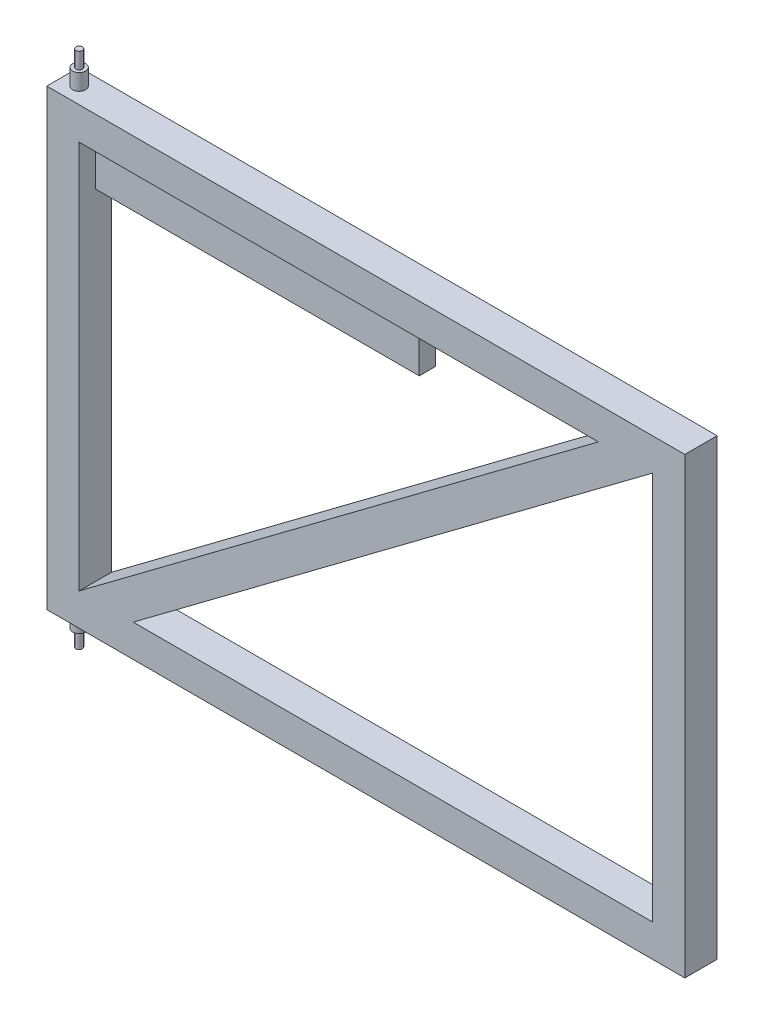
ISO-10303-21;
HEADER;
FILE_DESCRIPTION(('STEP AP214'),'2;1');
FILE_NAME('part.step','',(''),(''),'','','');
FILE_SCHEMA(('AUTOMOTIVE_DESIGN { 1 0 10303 214 1 1 1 1 }'));
ENDSEC;
DATA;
#1=APPLICATION_CONTEXT('core data for automotive mechanical design processes');
#2=APPLICATION_PROTOCOL_DEFINITION('international standard','automotive_design',2000,#1);
#3=PRODUCT_CONTEXT('',#1,'mechanical');
#4=PRODUCT('Part','Part','',(#3));
#5=PRODUCT_RELATED_PRODUCT_CATEGORY('part','',(#4));
#6=PRODUCT_DEFINITION_FORMATION('','',#4);
#7=PRODUCT_DEFINITION_CONTEXT('part definition',#1,'design');
#8=PRODUCT_DEFINITION('design','',#6,#7);
#9=PRODUCT_DEFINITION_SHAPE('','',#8);
#10=(LENGTH_UNIT() NAMED_UNIT(*) SI_UNIT(.MILLI.,.METRE.));
#11=(NAMED_UNIT(*) PLANE_ANGLE_UNIT() SI_UNIT($,.RADIAN.));
#12=(NAMED_UNIT(*) SI_UNIT($,.STERADIAN.) SOLID_ANGLE_UNIT());
#13=UNCERTAINTY_MEASURE_WITH_UNIT(LENGTH_MEASURE(1.E-05),#10,'distance_accuracy_value','');
#14=(GEOMETRIC_REPRESENTATION_CONTEXT(3) GLOBAL_UNCERTAINTY_ASSIGNED_CONTEXT((#13)) GLOBAL_UNIT_ASSIGNED_CONTEXT((#10,
#11,#12)) REPRESENTATION_CONTEXT('',''));
#15=CARTESIAN_POINT('',(0.,0.,0.));
#16=DIRECTION('',(0.,0.,1.));
#17=DIRECTION('',(1.,0.,0.));
#18=AXIS2_PLACEMENT_3D('',#15,#16,#17);
#19=CARTESIAN_POINT('',(-492.5,-350.,25.));
#20=DIRECTION('',(0.,1.,0.));
#21=DIRECTION('',(0.,0.,1.));
#22=AXIS2_PLACEMENT_3D('',#19,#20,#21);
#23=PLANE('',#22);
#24=DIRECTION('',(1.,0.,0.));
#25=VECTOR('',#24,1.);
#26=CARTESIAN_POINT('',(-492.5,-350.,-25.));
#27=LINE('',#26,#25);
#28=CARTESIAN_POINT('',(-492.5,-350.,-25.));
#29=VERTEX_POINT('',#28);
#30=CARTESIAN_POINT('',(492.5,-350.,-25.));
#31=VERTEX_POINT('',#30);
#32=EDGE_CURVE('E226',#29,#31,#27,.T.);
#33=ORIENTED_EDGE('',*,*,#32,.T.);
#34=DIRECTION('',(0.,0.,-1.));
#35=VECTOR('',#34,1.);
#36=CARTESIAN_POINT('',(492.5,-350.,25.));
#37=LINE('',#36,#35);
#38=CARTESIAN_POINT('',(492.5,-350.,25.));
#39=VERTEX_POINT('',#38);
#40=EDGE_CURVE('E247',#39,#31,#37,.T.);
#41=ORIENTED_EDGE('',*,*,#40,.F.);
#42=DIRECTION('',(1.,0.,0.));
#43=VECTOR('',#42,1.);
#44=CARTESIAN_POINT('',(-492.5,-350.,25.));
#45=LINE('',#44,#43);
#46=CARTESIAN_POINT('',(-492.5,-350.,25.));
#47=VERTEX_POINT('',#46);
#48=EDGE_CURVE('E235',#47,#39,#45,.T.);
#49=ORIENTED_EDGE('',*,*,#48,.F.);
#50=DIRECTION('',(0.,0.,-1.));
#51=VECTOR('',#50,1.);
#52=CARTESIAN_POINT('',(-492.5,-350.,25.));
#53=LINE('',#52,#51);
#54=EDGE_CURVE('E250',#47,#29,#53,.T.);
#55=ORIENTED_EDGE('',*,*,#54,.T.);
#56=EDGE_LOOP('',(#33,#41,#49,#55));
#57=FACE_BOUND('',#56,.T.);
#58=CARTESIAN_POINT('',(-467.5,-350.,0.));
#59=DIRECTION('',(0.,1.,0.));
#60=DIRECTION('',(0.,0.,1.));
#61=AXIS2_PLACEMENT_3D('',#58,#59,#60);
#62=CIRCLE('',#61,9.99999999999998);
#63=CARTESIAN_POINT('',(-467.5,-350.,10.));
#64=VERTEX_POINT('',#63);
#65=EDGE_CURVE('E11',#64,#64,#62,.F.);
#66=ORIENTED_EDGE('',*,*,#65,.F.);
#67=EDGE_LOOP('',(#66));
#68=FACE_BOUND('',#67,.T.);
#69=ADVANCED_FACE('F40',(#57,#68),#23,.F.);
#70=CARTESIAN_POINT('',(-492.5,350.,25.));
#71=DIRECTION('',(0.,-1.,0.));
#72=DIRECTION('',(0.,0.,-1.));
#73=AXIS2_PLACEMENT_3D('',#70,#71,#72);
#74=PLANE('',#73);
#75=DIRECTION('',(-1.,0.,0.));
#76=VECTOR('',#75,1.);
#77=CARTESIAN_POINT('',(-492.5,350.,-25.));
#78=LINE('',#77,#76);
#79=CARTESIAN_POINT('',(492.5,350.,-25.));
#80=VERTEX_POINT('',#79);
#81=CARTESIAN_POINT('',(-492.5,350.,-25.));
#82=VERTEX_POINT('',#81);
#83=EDGE_CURVE('E230',#80,#82,#78,.T.);
#84=ORIENTED_EDGE('',*,*,#83,.T.);
#85=DIRECTION('',(0.,0.,-1.));
#86=VECTOR('',#85,1.);
#87=CARTESIAN_POINT('',(-492.5,350.,25.));
#88=LINE('',#87,#86);
#89=CARTESIAN_POINT('',(-492.5,350.,25.));
#90=VERTEX_POINT('',#89);
#91=EDGE_CURVE('E241',#90,#82,#88,.T.);
#92=ORIENTED_EDGE('',*,*,#91,.F.);
#93=DIRECTION('',(-1.,0.,0.));
#94=VECTOR('',#93,1.);
#95=CARTESIAN_POINT('',(-492.5,350.,25.));
#96=LINE('',#95,#94);
#97=CARTESIAN_POINT('',(492.5,350.,25.));
#98=VERTEX_POINT('',#97);
#99=EDGE_CURVE('E239',#98,#90,#96,.T.);
#100=ORIENTED_EDGE('',*,*,#99,.F.);
#101=DIRECTION('',(0.,0.,-1.));
#102=VECTOR('',#101,1.);
#103=CARTESIAN_POINT('',(492.5,350.,25.));
#104=LINE('',#103,#102);
#105=EDGE_CURVE('E244',#98,#80,#104,.T.);
#106=ORIENTED_EDGE('',*,*,#105,.T.);
#107=EDGE_LOOP('',(#84,#92,#100,#106));
#108=FACE_BOUND('',#107,.T.);
#109=CARTESIAN_POINT('',(-467.5,350.,0.));
#110=DIRECTION('',(0.,-1.,0.));
#111=DIRECTION('',(0.,0.,-1.));
#112=AXIS2_PLACEMENT_3D('',#109,#110,#111);
#113=CIRCLE('',#112,9.99999999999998);
#114=CARTESIAN_POINT('',(-467.5,350.,-9.99999999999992));
#115=VERTEX_POINT('',#114);
#116=EDGE_CURVE('E44',#115,#115,#113,.F.);
#117=ORIENTED_EDGE('',*,*,#116,.F.);
#118=EDGE_LOOP('',(#117));
#119=FACE_BOUND('',#118,.T.);
#120=ADVANCED_FACE('F279',(#108,#119),#74,.F.);
#121=CARTESIAN_POINT('',(-492.5,-350.,25.));
#122=DIRECTION('',(0.,0.,1.));
#123=DIRECTION('',(1.,0.,0.));
#124=AXIS2_PLACEMENT_3D('',#121,#122,#123);
#125=PLANE('',#124);
#126=DIRECTION('',(0.800561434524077,0.599250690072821,0.));
#127=VECTOR('',#126,1.);
#128=CARTESIAN_POINT('',(359.062465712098,300.,25.));
#129=LINE('',#128,#127);
#130=CARTESIAN_POINT('',(-442.5,-300.,25.));
#131=VERTEX_POINT('',#130);
#132=CARTESIAN_POINT('',(359.062465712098,300.,25.));
#133=VERTEX_POINT('',#132);
#134=EDGE_CURVE('E212',#131,#133,#129,.T.);
#135=ORIENTED_EDGE('',*,*,#134,.F.);
#136=DIRECTION('',(0.,-1.,0.));
#137=VECTOR('',#136,1.);
#138=CARTESIAN_POINT('',(-442.5,300.,25.));
#139=LINE('',#138,#137);
#140=CARTESIAN_POINT('',(-442.5,300.,25.));
#141=VERTEX_POINT('',#140);
#142=EDGE_CURVE('E210',#141,#131,#139,.T.);
#143=ORIENTED_EDGE('',*,*,#142,.F.);
#144=DIRECTION('',(-1.,0.,0.));
#145=VECTOR('',#144,1.);
#146=CARTESIAN_POINT('',(-442.5,300.,25.));
#147=LINE('',#146,#145);
#148=EDGE_CURVE('E215',#133,#141,#147,.T.);
#149=ORIENTED_EDGE('',*,*,#148,.F.);
#150=EDGE_LOOP('',(#135,#143,#149));
#151=FACE_BOUND('',#150,.T.);
#152=DIRECTION('',(0.,-1.,0.));
#153=VECTOR('',#152,1.);
#154=CARTESIAN_POINT('',(-492.5,350.,25.));
#155=LINE('',#154,#153);
#156=EDGE_CURVE('E232',#90,#47,#155,.T.);
#157=ORIENTED_EDGE('',*,*,#156,.T.);
#158=ORIENTED_EDGE('',*,*,#48,.T.);
#159=DIRECTION('',(0.,1.,0.));
#160=VECTOR('',#159,1.);
#161=CARTESIAN_POINT('',(492.5,350.,25.));
#162=LINE('',#161,#160);
#163=EDGE_CURVE('E237',#39,#98,#162,.T.);
#164=ORIENTED_EDGE('',*,*,#163,.T.);
#165=ORIENTED_EDGE('',*,*,#99,.T.);
#166=EDGE_LOOP('',(#157,#158,#164,#165));
#167=FACE_BOUND('',#166,.T.);
#168=DIRECTION('',(0.,1.,0.));
#169=VECTOR('',#168,1.);
#170=CARTESIAN_POINT('',(442.5,300.,25.));
#171=LINE('',#170,#169);
#172=CARTESIAN_POINT('',(442.5,-300.,25.));
#173=VERTEX_POINT('',#172);
#174=CARTESIAN_POINT('',(442.5,300.,25.));
#175=VERTEX_POINT('',#174);
#176=EDGE_CURVE('E190',#173,#175,#171,.T.);
#177=ORIENTED_EDGE('',*,*,#176,.F.);
#178=DIRECTION('',(1.,0.,0.));
#179=VECTOR('',#178,1.);
#180=CARTESIAN_POINT('',(-359.062465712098,-300.,25.));
#181=LINE('',#180,#179);
#182=CARTESIAN_POINT('',(-359.062465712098,-300.,25.));
#183=VERTEX_POINT('',#182);
#184=EDGE_CURVE('E188',#183,#173,#181,.T.);
#185=ORIENTED_EDGE('',*,*,#184,.F.);
#186=DIRECTION('',(-0.800561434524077,-0.599250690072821,0.));
#187=VECTOR('',#186,1.);
#188=CARTESIAN_POINT('',(442.5,300.,25.));
#189=LINE('',#188,#187);
#190=EDGE_CURVE('E193',#175,#183,#189,.T.);
#191=ORIENTED_EDGE('',*,*,#190,.F.);
#192=EDGE_LOOP('',(#177,#185,#191));
#193=FACE_BOUND('',#192,.T.);
#194=ADVANCED_FACE('F284',(#151,#167,#193),#125,.T.);
#195=CARTESIAN_POINT('',(-492.5,-350.,-25.));
#196=DIRECTION('',(0.,0.,1.));
#197=DIRECTION('',(1.,0.,0.));
#198=AXIS2_PLACEMENT_3D('',#195,#196,#197);
#199=PLANE('',#198);
#200=DIRECTION('',(1.,0.,0.));
#201=VECTOR('',#200,1.);
#202=CARTESIAN_POINT('',(-442.5,225.,-25.));
#203=LINE('',#202,#201);
#204=CARTESIAN_POINT('',(-442.5,225.,-25.));
#205=VERTEX_POINT('',#204);
#206=CARTESIAN_POINT('',(57.4999999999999,225.,-25.));
#207=VERTEX_POINT('',#206);
#208=EDGE_CURVE('E141',#205,#207,#203,.T.);
#209=ORIENTED_EDGE('',*,*,#208,.F.);
#210=DIRECTION('',(0.,-1.,0.));
#211=VECTOR('',#210,1.);
#212=CARTESIAN_POINT('',(-442.5,300.,-25.));
#213=LINE('',#212,#211);
#214=CARTESIAN_POINT('',(-442.5,-300.,-25.));
#215=VERTEX_POINT('',#214);
#216=EDGE_CURVE('E61',#205,#215,#213,.T.);
#217=ORIENTED_EDGE('',*,*,#216,.T.);
#218=DIRECTION('',(0.800561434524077,0.599250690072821,0.));
#219=VECTOR('',#218,1.);
#220=CARTESIAN_POINT('',(359.062465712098,300.,-25.));
#221=LINE('',#220,#219);
#222=CARTESIAN_POINT('',(359.062465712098,300.,-25.));
#223=VERTEX_POINT('',#222);
#224=EDGE_CURVE('E204',#215,#223,#221,.T.);
#225=ORIENTED_EDGE('',*,*,#224,.T.);
#226=DIRECTION('',(-1.,0.,0.));
#227=VECTOR('',#226,1.);
#228=CARTESIAN_POINT('',(-442.5,300.,-25.));
#229=LINE('',#228,#227);
#230=CARTESIAN_POINT('',(57.4999999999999,300.,-25.));
#231=VERTEX_POINT('',#230);
#232=EDGE_CURVE('E207',#223,#231,#229,.T.);
#233=ORIENTED_EDGE('',*,*,#232,.T.);
#234=DIRECTION('',(0.,1.,0.));
#235=VECTOR('',#234,1.);
#236=CARTESIAN_POINT('',(57.5,300.,-25.));
#237=LINE('',#236,#235);
#238=EDGE_CURVE('E162',#207,#231,#237,.T.);
#239=ORIENTED_EDGE('',*,*,#238,.F.);
#240=EDGE_LOOP('',(#209,#217,#225,#233,#239));
#241=FACE_BOUND('',#240,.T.);
#242=DIRECTION('',(0.,-1.,0.));
#243=VECTOR('',#242,1.);
#244=CARTESIAN_POINT('',(-492.5,350.,-25.));
#245=LINE('',#244,#243);
#246=EDGE_CURVE('E223',#82,#29,#245,.T.);
#247=ORIENTED_EDGE('',*,*,#246,.F.);
#248=ORIENTED_EDGE('',*,*,#83,.F.);
#249=DIRECTION('',(0.,1.,0.));
#250=VECTOR('',#249,1.);
#251=CARTESIAN_POINT('',(492.5,350.,-25.));
#252=LINE('',#251,#250);
#253=EDGE_CURVE('E228',#31,#80,#252,.T.);
#254=ORIENTED_EDGE('',*,*,#253,.F.);
#255=ORIENTED_EDGE('',*,*,#32,.F.);
#256=EDGE_LOOP('',(#247,#248,#254,#255));
#257=FACE_BOUND('',#256,.T.);
#258=DIRECTION('',(1.,0.,0.));
#259=VECTOR('',#258,1.);
#260=CARTESIAN_POINT('',(-359.062465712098,-300.,-25.));
#261=LINE('',#260,#259);
#262=CARTESIAN_POINT('',(-359.062465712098,-300.,-25.));
#263=VERTEX_POINT('',#262);
#264=CARTESIAN_POINT('',(442.5,-300.,-25.));
#265=VERTEX_POINT('',#264);
#266=EDGE_CURVE('E179',#263,#265,#261,.T.);
#267=ORIENTED_EDGE('',*,*,#266,.T.);
#268=DIRECTION('',(0.,1.,0.));
#269=VECTOR('',#268,1.);
#270=CARTESIAN_POINT('',(442.5,300.,-25.));
#271=LINE('',#270,#269);
#272=CARTESIAN_POINT('',(442.5,300.,-25.));
#273=VERTEX_POINT('',#272);
#274=EDGE_CURVE('E182',#265,#273,#271,.T.);
#275=ORIENTED_EDGE('',*,*,#274,.T.);
#276=DIRECTION('',(-0.800561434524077,-0.599250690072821,0.));
#277=VECTOR('',#276,1.);
#278=CARTESIAN_POINT('',(442.5,300.,-25.));
#279=LINE('',#278,#277);
#280=EDGE_CURVE('E185',#273,#263,#279,.T.);
#281=ORIENTED_EDGE('',*,*,#280,.T.);
#282=EDGE_LOOP('',(#267,#275,#281));
#283=FACE_BOUND('',#282,.T.);
#284=ADVANCED_FACE('F296',(#241,#257,#283),#199,.F.);
#285=CARTESIAN_POINT('',(-492.5,350.,25.));
#286=DIRECTION('',(1.,0.,0.));
#287=DIRECTION('',(0.,1.,0.));
#288=AXIS2_PLACEMENT_3D('',#285,#286,#287);
#289=PLANE('',#288);
#290=ORIENTED_EDGE('',*,*,#246,.T.);
#291=ORIENTED_EDGE('',*,*,#54,.F.);
#292=ORIENTED_EDGE('',*,*,#156,.F.);
#293=ORIENTED_EDGE('',*,*,#91,.T.);
#294=EDGE_LOOP('',(#290,#291,#292,#293));
#295=FACE_BOUND('',#294,.T.);
#296=ADVANCED_FACE('F42',(#295),#289,.F.);
#297=CARTESIAN_POINT('',(492.5,350.,25.));
#298=DIRECTION('',(-1.,0.,0.));
#299=DIRECTION('',(0.,-1.,0.));
#300=AXIS2_PLACEMENT_3D('',#297,#298,#299);
#301=PLANE('',#300);
#302=ORIENTED_EDGE('',*,*,#253,.T.);
#303=ORIENTED_EDGE('',*,*,#105,.F.);
#304=ORIENTED_EDGE('',*,*,#163,.F.);
#305=ORIENTED_EDGE('',*,*,#40,.T.);
#306=EDGE_LOOP('',(#302,#303,#304,#305));
#307=FACE_BOUND('',#306,.T.);
#308=ADVANCED_FACE('F289',(#307),#301,.F.);
#309=CARTESIAN_POINT('',(-442.5,300.,25.));
#310=DIRECTION('',(1.,0.,0.));
#311=DIRECTION('',(0.,1.,0.));
#312=AXIS2_PLACEMENT_3D('',#309,#310,#311);
#313=PLANE('',#312);
#314=DIRECTION('',(0.,0.,1.));
#315=VECTOR('',#314,1.);
#316=CARTESIAN_POINT('',(-442.5,225.,-25.));
#317=LINE('',#316,#315);
#318=CARTESIAN_POINT('',(-442.5,225.,0.));
#319=VERTEX_POINT('',#318);
#320=EDGE_CURVE('E56',#205,#319,#317,.T.);
#321=ORIENTED_EDGE('',*,*,#320,.T.);
#322=DIRECTION('',(0.,-1.,0.));
#323=VECTOR('',#322,1.);
#324=CARTESIAN_POINT('',(-442.5,300.,0.));
#325=LINE('',#324,#323);
#326=CARTESIAN_POINT('',(-442.5,300.,0.));
#327=VERTEX_POINT('',#326);
#328=EDGE_CURVE('E156',#327,#319,#325,.T.);
#329=ORIENTED_EDGE('',*,*,#328,.F.);
#330=DIRECTION('',(0.,0.,-1.));
#331=VECTOR('',#330,1.);
#332=CARTESIAN_POINT('',(-442.5,300.,25.));
#333=LINE('',#332,#331);
#334=EDGE_CURVE('E217',#141,#327,#333,.T.);
#335=ORIENTED_EDGE('',*,*,#334,.F.);
#336=ORIENTED_EDGE('',*,*,#142,.T.);
#337=DIRECTION('',(0.,0.,-1.));
#338=VECTOR('',#337,1.);
#339=CARTESIAN_POINT('',(-442.5,-300.,25.));
#340=LINE('',#339,#338);
#341=EDGE_CURVE('E221',#131,#215,#340,.T.);
#342=ORIENTED_EDGE('',*,*,#341,.T.);
#343=ORIENTED_EDGE('',*,*,#216,.F.);
#344=EDGE_LOOP('',(#321,#329,#335,#336,#342,#343));
#345=FACE_BOUND('',#344,.T.);
#346=ADVANCED_FACE('F291',(#345),#313,.T.);
#347=CARTESIAN_POINT('',(359.062465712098,300.,25.));
#348=DIRECTION('',(-0.599250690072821,0.800561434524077,0.));
#349=DIRECTION('',(-0.800561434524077,-0.599250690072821,0.));
#350=AXIS2_PLACEMENT_3D('',#347,#348,#349);
#351=PLANE('',#350);
#352=ORIENTED_EDGE('',*,*,#224,.F.);
#353=ORIENTED_EDGE('',*,*,#341,.F.);
#354=ORIENTED_EDGE('',*,*,#134,.T.);
#355=DIRECTION('',(0.,0.,-1.));
#356=VECTOR('',#355,1.);
#357=CARTESIAN_POINT('',(359.062465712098,300.,25.));
#358=LINE('',#357,#356);
#359=EDGE_CURVE('E219',#133,#223,#358,.T.);
#360=ORIENTED_EDGE('',*,*,#359,.T.);
#361=EDGE_LOOP('',(#352,#353,#354,#360));
#362=FACE_BOUND('',#361,.T.);
#363=ADVANCED_FACE('F303',(#362),#351,.T.);
#364=CARTESIAN_POINT('',(-442.5,300.,25.));
#365=DIRECTION('',(0.,-1.,0.));
#366=DIRECTION('',(0.,0.,-1.));
#367=AXIS2_PLACEMENT_3D('',#364,#365,#366);
#368=PLANE('',#367);
#369=DIRECTION('',(0.,0.,1.));
#370=VECTOR('',#369,1.);
#371=CARTESIAN_POINT('',(57.5,300.,-25.));
#372=LINE('',#371,#370);
#373=CARTESIAN_POINT('',(57.4999999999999,300.,0.));
#374=VERTEX_POINT('',#373);
#375=EDGE_CURVE('E145',#231,#374,#372,.T.);
#376=ORIENTED_EDGE('',*,*,#375,.F.);
#377=ORIENTED_EDGE('',*,*,#232,.F.);
#378=ORIENTED_EDGE('',*,*,#359,.F.);
#379=ORIENTED_EDGE('',*,*,#148,.T.);
#380=ORIENTED_EDGE('',*,*,#334,.T.);
#381=DIRECTION('',(-1.,0.,0.));
#382=VECTOR('',#381,1.);
#383=CARTESIAN_POINT('',(-442.5,300.,0.));
#384=LINE('',#383,#382);
#385=EDGE_CURVE('E153',#374,#327,#384,.T.);
#386=ORIENTED_EDGE('',*,*,#385,.F.);
#387=EDGE_LOOP('',(#376,#377,#378,#379,#380,#386));
#388=FACE_BOUND('',#387,.T.);
#389=ADVANCED_FACE('F306',(#388),#368,.T.);
#390=CARTESIAN_POINT('',(-359.062465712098,-300.,25.));
#391=DIRECTION('',(0.,1.,0.));
#392=DIRECTION('',(-1.,0.,0.));
#393=AXIS2_PLACEMENT_3D('',#390,#391,#392);
#394=PLANE('',#393);
#395=ORIENTED_EDGE('',*,*,#266,.F.);
#396=DIRECTION('',(0.,0.,-1.));
#397=VECTOR('',#396,1.);
#398=CARTESIAN_POINT('',(-359.062465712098,-300.,25.));
#399=LINE('',#398,#397);
#400=EDGE_CURVE('E195',#183,#263,#399,.T.);
#401=ORIENTED_EDGE('',*,*,#400,.F.);
#402=ORIENTED_EDGE('',*,*,#184,.T.);
#403=DIRECTION('',(0.,0.,-1.));
#404=VECTOR('',#403,1.);
#405=CARTESIAN_POINT('',(442.5,-300.,25.));
#406=LINE('',#405,#404);
#407=EDGE_CURVE('E200',#173,#265,#406,.T.);
#408=ORIENTED_EDGE('',*,*,#407,.T.);
#409=EDGE_LOOP('',(#395,#401,#402,#408));
#410=FACE_BOUND('',#409,.T.);
#411=ADVANCED_FACE('F310',(#410),#394,.T.);
#412=CARTESIAN_POINT('',(442.5,300.,25.));
#413=DIRECTION('',(-1.,0.,0.));
#414=DIRECTION('',(0.,-1.,0.));
#415=AXIS2_PLACEMENT_3D('',#412,#413,#414);
#416=PLANE('',#415);
#417=ORIENTED_EDGE('',*,*,#274,.F.);
#418=ORIENTED_EDGE('',*,*,#407,.F.);
#419=ORIENTED_EDGE('',*,*,#176,.T.);
#420=DIRECTION('',(0.,0.,-1.));
#421=VECTOR('',#420,1.);
#422=CARTESIAN_POINT('',(442.5,300.,25.));
#423=LINE('',#422,#421);
#424=EDGE_CURVE('E198',#175,#273,#423,.T.);
#425=ORIENTED_EDGE('',*,*,#424,.T.);
#426=EDGE_LOOP('',(#417,#418,#419,#425));
#427=FACE_BOUND('',#426,.T.);
#428=ADVANCED_FACE('F314',(#427),#416,.T.);
#429=CARTESIAN_POINT('',(442.5,300.,25.));
#430=DIRECTION('',(0.599250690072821,-0.800561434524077,0.));
#431=DIRECTION('',(0.800561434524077,0.599250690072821,0.));
#432=AXIS2_PLACEMENT_3D('',#429,#430,#431);
#433=PLANE('',#432);
#434=ORIENTED_EDGE('',*,*,#280,.F.);
#435=ORIENTED_EDGE('',*,*,#424,.F.);
#436=ORIENTED_EDGE('',*,*,#190,.T.);
#437=ORIENTED_EDGE('',*,*,#400,.T.);
#438=EDGE_LOOP('',(#434,#435,#436,#437));
#439=FACE_BOUND('',#438,.T.);
#440=ADVANCED_FACE('F318',(#439),#433,.T.);
#441=CARTESIAN_POINT('',(-467.5,-375.,0.));
#442=DIRECTION('',(0.,1.,0.));
#443=DIRECTION('',(0.,0.,1.));
#444=AXIS2_PLACEMENT_3D('',#441,#442,#443);
#445=PLANE('',#444);
#446=CARTESIAN_POINT('',(-467.5,-375.,0.));
#447=DIRECTION('',(0.,1.,0.));
#448=DIRECTION('',(0.,0.,1.));
#449=AXIS2_PLACEMENT_3D('',#446,#447,#448);
#450=CIRCLE('',#449,9.99999999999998);
#451=CARTESIAN_POINT('',(-467.5,-375.,10.));
#452=VERTEX_POINT('',#451);
#453=EDGE_CURVE('E164',#452,#452,#450,.T.);
#454=ORIENTED_EDGE('',*,*,#453,.F.);
#455=EDGE_LOOP('',(#454));
#456=FACE_BOUND('',#455,.T.);
#457=CARTESIAN_POINT('',(-467.5,-375.,0.));
#458=DIRECTION('',(0.,1.,0.));
#459=DIRECTION('',(0.,0.,1.));
#460=AXIS2_PLACEMENT_3D('',#457,#458,#459);
#461=CIRCLE('',#460,4.99999999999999);
#462=CARTESIAN_POINT('',(-467.5,-375.,5.00000000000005));
#463=VERTEX_POINT('',#462);
#464=EDGE_CURVE('E253',#463,#463,#461,.T.);
#465=ORIENTED_EDGE('',*,*,#464,.T.);
#466=EDGE_LOOP('',(#465));
#467=FACE_BOUND('',#466,.T.);
#468=ADVANCED_FACE('F322',(#456,#467),#445,.F.);
#469=CARTESIAN_POINT('',(-467.5,375.,0.));
#470=DIRECTION('',(0.,-1.,0.));
#471=DIRECTION('',(0.,0.,-1.));
#472=AXIS2_PLACEMENT_3D('',#469,#470,#471);
#473=CYLINDRICAL_SURFACE('',#472,9.99999999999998);
#474=ORIENTED_EDGE('',*,*,#453,.T.);
#475=EDGE_LOOP('',(#474));
#476=FACE_BOUND('',#475,.T.);
#477=ORIENTED_EDGE('',*,*,#65,.T.);
#478=EDGE_LOOP('',(#477));
#479=FACE_BOUND('',#478,.T.);
#480=ADVANCED_FACE('F276',(#476,#479),#473,.T.);
#481=CARTESIAN_POINT('',(-467.5,-400.,0.));
#482=DIRECTION('',(0.,1.,0.));
#483=DIRECTION('',(0.,0.,1.));
#484=AXIS2_PLACEMENT_3D('',#481,#482,#483);
#485=PLANE('',#484);
#486=CARTESIAN_POINT('',(-467.5,-400.,0.));
#487=DIRECTION('',(0.,1.,0.));
#488=DIRECTION('',(0.,0.,1.));
#489=AXIS2_PLACEMENT_3D('',#486,#487,#488);
#490=CIRCLE('',#489,4.99999999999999);
#491=CARTESIAN_POINT('',(-467.5,-400.,5.00000000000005));
#492=VERTEX_POINT('',#491);
#493=EDGE_CURVE('E173',#492,#492,#490,.T.);
#494=ORIENTED_EDGE('',*,*,#493,.F.);
#495=EDGE_LOOP('',(#494));
#496=FACE_BOUND('',#495,.T.);
#497=ADVANCED_FACE('F325',(#496),#485,.F.);
#498=CARTESIAN_POINT('',(-467.5,400.,0.));
#499=DIRECTION('',(0.,-1.,0.));
#500=DIRECTION('',(0.,0.,-1.));
#501=AXIS2_PLACEMENT_3D('',#498,#499,#500);
#502=CYLINDRICAL_SURFACE('',#501,4.99999999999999);
#503=ORIENTED_EDGE('',*,*,#493,.T.);
#504=EDGE_LOOP('',(#503));
#505=FACE_BOUND('',#504,.T.);
#506=ORIENTED_EDGE('',*,*,#464,.F.);
#507=EDGE_LOOP('',(#506));
#508=FACE_BOUND('',#507,.T.);
#509=ADVANCED_FACE('F273',(#505,#508),#502,.T.);
#510=CARTESIAN_POINT('',(-467.5,375.,0.));
#511=DIRECTION('',(0.,1.,0.));
#512=DIRECTION('',(0.,0.,1.));
#513=AXIS2_PLACEMENT_3D('',#510,#511,#512);
#514=CIRCLE('',#513,9.99999999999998);
#515=CARTESIAN_POINT('',(-467.5,375.,10.));
#516=VERTEX_POINT('',#515);
#517=EDGE_CURVE('E169',#516,#516,#514,.T.);
#518=ORIENTED_EDGE('',*,*,#517,.F.);
#519=EDGE_LOOP('',(#518));
#520=FACE_BOUND('',#519,.T.);
#521=ORIENTED_EDGE('',*,*,#116,.T.);
#522=EDGE_LOOP('',(#521));
#523=FACE_BOUND('',#522,.T.);
#524=ADVANCED_FACE('F264',(#520,#523),#473,.T.);
#525=CARTESIAN_POINT('',(-467.5,375.,0.));
#526=DIRECTION('',(0.,1.,0.));
#527=DIRECTION('',(0.,0.,1.));
#528=AXIS2_PLACEMENT_3D('',#525,#526,#527);
#529=PLANE('',#528);
#530=ORIENTED_EDGE('',*,*,#517,.T.);
#531=EDGE_LOOP('',(#530));
#532=FACE_BOUND('',#531,.T.);
#533=CARTESIAN_POINT('',(-467.5,375.,0.));
#534=DIRECTION('',(0.,1.,0.));
#535=DIRECTION('',(0.,0.,1.));
#536=AXIS2_PLACEMENT_3D('',#533,#534,#535);
#537=CIRCLE('',#536,4.99999999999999);
#538=CARTESIAN_POINT('',(-467.5,375.,5.00000000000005));
#539=VERTEX_POINT('',#538);
#540=EDGE_CURVE('E171',#539,#539,#537,.T.);
#541=ORIENTED_EDGE('',*,*,#540,.F.);
#542=EDGE_LOOP('',(#541));
#543=FACE_BOUND('',#542,.T.);
#544=ADVANCED_FACE('F261',(#532,#543),#529,.T.);
#545=CARTESIAN_POINT('',(-467.5,400.,0.));
#546=DIRECTION('',(0.,1.,0.));
#547=DIRECTION('',(0.,0.,1.));
#548=AXIS2_PLACEMENT_3D('',#545,#546,#547);
#549=PLANE('',#548);
#550=CARTESIAN_POINT('',(-467.5,400.,0.));
#551=DIRECTION('',(0.,1.,0.));
#552=DIRECTION('',(0.,0.,1.));
#553=AXIS2_PLACEMENT_3D('',#550,#551,#552);
#554=CIRCLE('',#553,4.99999999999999);
#555=CARTESIAN_POINT('',(-467.5,400.,5.00000000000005));
#556=VERTEX_POINT('',#555);
#557=EDGE_CURVE('E176',#556,#556,#554,.T.);
#558=ORIENTED_EDGE('',*,*,#557,.T.);
#559=EDGE_LOOP('',(#558));
#560=FACE_BOUND('',#559,.T.);
#561=ADVANCED_FACE('F263',(#560),#549,.T.);
#562=ORIENTED_EDGE('',*,*,#540,.T.);
#563=EDGE_LOOP('',(#562));
#564=FACE_BOUND('',#563,.T.);
#565=ORIENTED_EDGE('',*,*,#557,.F.);
#566=EDGE_LOOP('',(#565));
#567=FACE_BOUND('',#566,.T.);
#568=ADVANCED_FACE('F258',(#564,#567),#502,.T.);
#569=CARTESIAN_POINT('',(57.5,300.,-25.));
#570=DIRECTION('',(1.,0.,0.));
#571=DIRECTION('',(0.,1.,0.));
#572=AXIS2_PLACEMENT_3D('',#569,#570,#571);
#573=PLANE('',#572);
#574=DIRECTION('',(0.,1.,0.));
#575=VECTOR('',#574,1.);
#576=CARTESIAN_POINT('',(57.5,300.,0.));
#577=LINE('',#576,#575);
#578=CARTESIAN_POINT('',(57.4999999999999,225.,0.));
#579=VERTEX_POINT('',#578);
#580=EDGE_CURVE('E149',#579,#374,#577,.T.);
#581=ORIENTED_EDGE('',*,*,#580,.F.);
#582=DIRECTION('',(0.,0.,1.));
#583=VECTOR('',#582,1.);
#584=CARTESIAN_POINT('',(57.4999999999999,225.,-25.));
#585=LINE('',#584,#583);
#586=EDGE_CURVE('E134',#207,#579,#585,.T.);
#587=ORIENTED_EDGE('',*,*,#586,.F.);
#588=ORIENTED_EDGE('',*,*,#238,.T.);
#589=ORIENTED_EDGE('',*,*,#375,.T.);
#590=EDGE_LOOP('',(#581,#587,#588,#589));
#591=FACE_BOUND('',#590,.T.);
#592=ADVANCED_FACE('F150',(#591),#573,.T.);
#593=CARTESIAN_POINT('',(-442.5,225.,-25.));
#594=DIRECTION('',(0.,-1.,0.));
#595=DIRECTION('',(0.,0.,-1.));
#596=AXIS2_PLACEMENT_3D('',#593,#594,#595);
#597=PLANE('',#596);
#598=DIRECTION('',(1.,0.,0.));
#599=VECTOR('',#598,1.);
#600=CARTESIAN_POINT('',(-442.5,225.,0.));
#601=LINE('',#600,#599);
#602=EDGE_CURVE('E138',#319,#579,#601,.T.);
#603=ORIENTED_EDGE('',*,*,#602,.F.);
#604=ORIENTED_EDGE('',*,*,#320,.F.);
#605=ORIENTED_EDGE('',*,*,#208,.T.);
#606=ORIENTED_EDGE('',*,*,#586,.T.);
#607=EDGE_LOOP('',(#603,#604,#605,#606));
#608=FACE_BOUND('',#607,.T.);
#609=ADVANCED_FACE('F136',(#608),#597,.T.);
#610=CARTESIAN_POINT('',(-442.5,225.,0.));
#611=DIRECTION('',(0.,0.,1.));
#612=DIRECTION('',(1.,0.,0.));
#613=AXIS2_PLACEMENT_3D('',#610,#611,#612);
#614=PLANE('',#613);
#615=ORIENTED_EDGE('',*,*,#328,.T.);
#616=ORIENTED_EDGE('',*,*,#602,.T.);
#617=ORIENTED_EDGE('',*,*,#580,.T.);
#618=ORIENTED_EDGE('',*,*,#385,.T.);
#619=EDGE_LOOP('',(#615,#616,#617,#618));
#620=FACE_BOUND('',#619,.T.);
#621=ADVANCED_FACE('F155',(#620),#614,.T.);
#622=CLOSED_SHELL('',(#69,#120,#194,#284,#296,#308,#346,#363,#389,#411,#428,#440,#468,#480,#497,
#509,#524,#544,#561,#568,#592,#609,#621));
#623=MANIFOLD_SOLID_BREP('B2',#622);
#624=ADVANCED_BREP_SHAPE_REPRESENTATION('',(#18,#623),#14);
#625=SHAPE_DEFINITION_REPRESENTATION(#9,#624);
ENDSEC;
END-ISO-10303-21;
